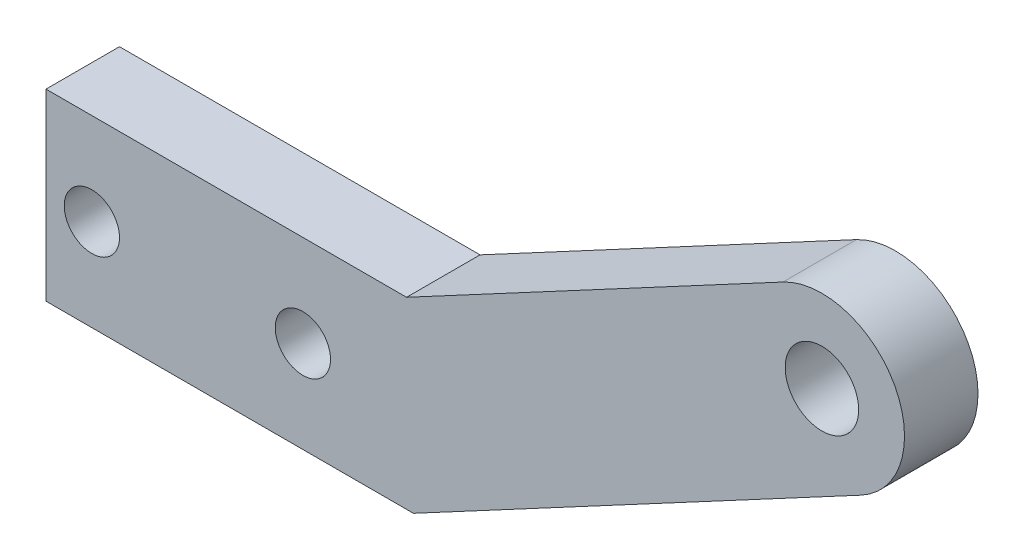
from build123d import *

# Parameters (mm, degrees)
SKETCH2_R           = 2.3876
SKETCH2_R_2         = 3.175
BOSS_EXTRUDE1_DEPTH = 6.35
CUT_EXTRUDE1_DEPTH  = 2.794


with BuildPart() as part:
    # Sketch2 → Boss-Extrude1 (new body)
    with BuildSketch(Plane.XY):
        with BuildLine():
            Line((0, -7.9375), (31.75, -7.9375))
            Line((31.75, -7.9375), (70.42346248, 12.756934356))
            ThreePointArc((70.42346248, 12.756934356), (73.349065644, 22.41746248), (63.68853752, 25.343065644))
            Line((63.68853752, 25.343065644), (31.161265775, 7.9375))
            Line((31.161265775, 7.9375), (0, 7.9375))
            Line((0, 7.9375), (0, 0))
            Line((0, 0), (0, -7.9375))
        make_face()
        with Locations((3.9624, 0)):
            Circle(SKETCH2_R, mode=Mode.SUBTRACT)
        with Locations((22.1996, 0)):
            Circle(SKETCH2_R, mode=Mode.SUBTRACT)
        with Locations((67.056, 19.05)):
            Circle(SKETCH2_R_2, mode=Mode.SUBTRACT)
    extrude(amount=BOSS_EXTRUDE1_DEPTH)

    # Sketch5 → Cut-Extrude1 (cut)
    with BuildSketch(Plane.XY):
        with BuildLine():
            Line((0, -3.175), (25.4, -3.175))
            ThreePointArc((25.4, -3.175), (28.575, 0), (25.4, 3.175))
            Line((25.4, 3.175), (0, 3.175))
            ThreePointArc((0, 3.175), (-3.175, 0), (0, -3.175))
        make_face()
    extrude(amount=CUT_EXTRUDE1_DEPTH, mode=Mode.SUBTRACT)


solid = part.part
